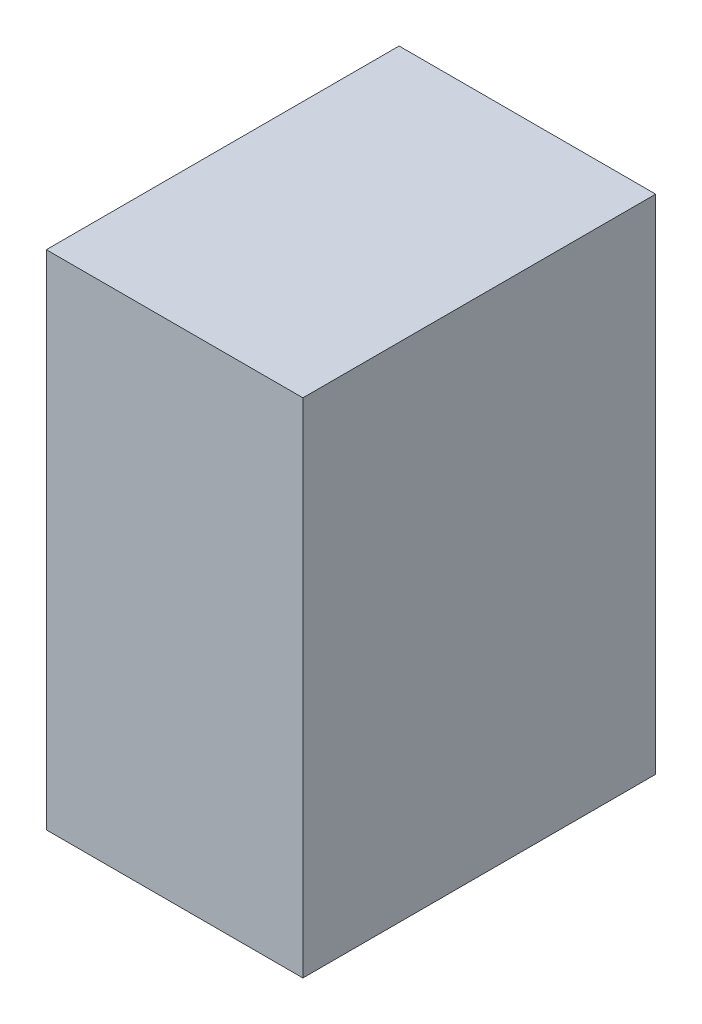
ISO-10303-21;
HEADER;
FILE_DESCRIPTION(('STEP AP214'),'2;1');
FILE_NAME('part.step','',(''),(''),'','','');
FILE_SCHEMA(('AUTOMOTIVE_DESIGN { 1 0 10303 214 1 1 1 1 }'));
ENDSEC;
DATA;
#1=APPLICATION_CONTEXT('core data for automotive mechanical design processes');
#2=APPLICATION_PROTOCOL_DEFINITION('international standard','automotive_design',2000,#1);
#3=PRODUCT_CONTEXT('',#1,'mechanical');
#4=PRODUCT('Part','Part','',(#3));
#5=PRODUCT_RELATED_PRODUCT_CATEGORY('part','',(#4));
#6=PRODUCT_DEFINITION_FORMATION('','',#4);
#7=PRODUCT_DEFINITION_CONTEXT('part definition',#1,'design');
#8=PRODUCT_DEFINITION('design','',#6,#7);
#9=PRODUCT_DEFINITION_SHAPE('','',#8);
#10=(LENGTH_UNIT() NAMED_UNIT(*) SI_UNIT(.MILLI.,.METRE.));
#11=(NAMED_UNIT(*) PLANE_ANGLE_UNIT() SI_UNIT($,.RADIAN.));
#12=(NAMED_UNIT(*) SI_UNIT($,.STERADIAN.) SOLID_ANGLE_UNIT());
#13=UNCERTAINTY_MEASURE_WITH_UNIT(LENGTH_MEASURE(1.E-05),#10,'distance_accuracy_value','');
#14=(GEOMETRIC_REPRESENTATION_CONTEXT(3) GLOBAL_UNCERTAINTY_ASSIGNED_CONTEXT((#13)) GLOBAL_UNIT_ASSIGNED_CONTEXT((#10,
#11,#12)) REPRESENTATION_CONTEXT('',''));
#15=CARTESIAN_POINT('',(0.,0.,0.));
#16=DIRECTION('',(0.,0.,1.));
#17=DIRECTION('',(1.,0.,0.));
#18=AXIS2_PLACEMENT_3D('',#15,#16,#17);
#19=CARTESIAN_POINT('',(120.,230.,330.));
#20=DIRECTION('',(-1.,0.,0.));
#21=DIRECTION('',(0.,-1.,0.));
#22=AXIS2_PLACEMENT_3D('',#19,#20,#21);
#23=PLANE('',#22);
#24=DIRECTION('',(0.,1.,0.));
#25=VECTOR('',#24,1.);
#26=CARTESIAN_POINT('',(120.,230.,0.));
#27=LINE('',#26,#25);
#28=CARTESIAN_POINT('',(120.,-240.,0.));
#29=VERTEX_POINT('',#28);
#30=CARTESIAN_POINT('',(120.,230.,0.));
#31=VERTEX_POINT('',#30);
#32=EDGE_CURVE('E94',#29,#31,#27,.T.);
#33=ORIENTED_EDGE('',*,*,#32,.T.);
#34=DIRECTION('',(0.,0.,-1.));
#35=VECTOR('',#34,1.);
#36=CARTESIAN_POINT('',(120.,230.,330.));
#37=LINE('',#36,#35);
#38=CARTESIAN_POINT('',(120.,230.,330.));
#39=VERTEX_POINT('',#38);
#40=EDGE_CURVE('E11',#39,#31,#37,.T.);
#41=ORIENTED_EDGE('',*,*,#40,.F.);
#42=DIRECTION('',(0.,1.,0.));
#43=VECTOR('',#42,1.);
#44=CARTESIAN_POINT('',(120.,230.,330.));
#45=LINE('',#44,#43);
#46=CARTESIAN_POINT('',(120.,-240.,330.));
#47=VERTEX_POINT('',#46);
#48=EDGE_CURVE('E82',#47,#39,#45,.T.);
#49=ORIENTED_EDGE('',*,*,#48,.F.);
#50=DIRECTION('',(0.,0.,-1.));
#51=VECTOR('',#50,1.);
#52=CARTESIAN_POINT('',(120.,-240.,330.));
#53=LINE('',#52,#51);
#54=EDGE_CURVE('E90',#47,#29,#53,.T.);
#55=ORIENTED_EDGE('',*,*,#54,.T.);
#56=EDGE_LOOP('',(#33,#41,#49,#55));
#57=FACE_BOUND('',#56,.T.);
#58=ADVANCED_FACE('F31',(#57),#23,.F.);
#59=CARTESIAN_POINT('',(-120.,230.,330.));
#60=DIRECTION('',(0.,-1.,0.));
#61=DIRECTION('',(0.,0.,-1.));
#62=AXIS2_PLACEMENT_3D('',#59,#60,#61);
#63=PLANE('',#62);
#64=DIRECTION('',(-1.,0.,0.));
#65=VECTOR('',#64,1.);
#66=CARTESIAN_POINT('',(-120.,230.,0.));
#67=LINE('',#66,#65);
#68=CARTESIAN_POINT('',(-120.,230.,0.));
#69=VERTEX_POINT('',#68);
#70=EDGE_CURVE('E86',#31,#69,#67,.T.);
#71=ORIENTED_EDGE('',*,*,#70,.T.);
#72=DIRECTION('',(0.,0.,-1.));
#73=VECTOR('',#72,1.);
#74=CARTESIAN_POINT('',(-120.,230.,330.));
#75=LINE('',#74,#73);
#76=CARTESIAN_POINT('',(-120.,230.,330.));
#77=VERTEX_POINT('',#76);
#78=EDGE_CURVE('E39',#77,#69,#75,.T.);
#79=ORIENTED_EDGE('',*,*,#78,.F.);
#80=DIRECTION('',(-1.,0.,0.));
#81=VECTOR('',#80,1.);
#82=CARTESIAN_POINT('',(-120.,230.,330.));
#83=LINE('',#82,#81);
#84=EDGE_CURVE('E77',#39,#77,#83,.T.);
#85=ORIENTED_EDGE('',*,*,#84,.F.);
#86=ORIENTED_EDGE('',*,*,#40,.T.);
#87=EDGE_LOOP('',(#71,#79,#85,#86));
#88=FACE_BOUND('',#87,.T.);
#89=ADVANCED_FACE('F85',(#88),#63,.F.);
#90=CARTESIAN_POINT('',(-120.,230.,330.));
#91=DIRECTION('',(1.,0.,0.));
#92=DIRECTION('',(0.,1.,0.));
#93=AXIS2_PLACEMENT_3D('',#90,#91,#92);
#94=PLANE('',#93);
#95=DIRECTION('',(0.,-1.,0.));
#96=VECTOR('',#95,1.);
#97=CARTESIAN_POINT('',(-120.,230.,0.));
#98=LINE('',#97,#96);
#99=CARTESIAN_POINT('',(-120.,-240.,0.));
#100=VERTEX_POINT('',#99);
#101=EDGE_CURVE('E64',#69,#100,#98,.T.);
#102=ORIENTED_EDGE('',*,*,#101,.T.);
#103=DIRECTION('',(0.,0.,-1.));
#104=VECTOR('',#103,1.);
#105=CARTESIAN_POINT('',(-120.,-240.,330.));
#106=LINE('',#105,#104);
#107=CARTESIAN_POINT('',(-120.,-240.,330.));
#108=VERTEX_POINT('',#107);
#109=EDGE_CURVE('E87',#108,#100,#106,.T.);
#110=ORIENTED_EDGE('',*,*,#109,.F.);
#111=DIRECTION('',(0.,-1.,0.));
#112=VECTOR('',#111,1.);
#113=CARTESIAN_POINT('',(-120.,230.,330.));
#114=LINE('',#113,#112);
#115=EDGE_CURVE('E80',#77,#108,#114,.T.);
#116=ORIENTED_EDGE('',*,*,#115,.F.);
#117=ORIENTED_EDGE('',*,*,#78,.T.);
#118=EDGE_LOOP('',(#102,#110,#116,#117));
#119=FACE_BOUND('',#118,.T.);
#120=ADVANCED_FACE('F88',(#119),#94,.F.);
#121=CARTESIAN_POINT('',(-120.,-240.,330.));
#122=DIRECTION('',(0.,1.,0.));
#123=DIRECTION('',(0.,0.,1.));
#124=AXIS2_PLACEMENT_3D('',#121,#122,#123);
#125=PLANE('',#124);
#126=DIRECTION('',(1.,0.,0.));
#127=VECTOR('',#126,1.);
#128=CARTESIAN_POINT('',(-120.,-240.,0.));
#129=LINE('',#128,#127);
#130=EDGE_CURVE('E70',#100,#29,#129,.T.);
#131=ORIENTED_EDGE('',*,*,#130,.T.);
#132=ORIENTED_EDGE('',*,*,#54,.F.);
#133=DIRECTION('',(1.,0.,0.));
#134=VECTOR('',#133,1.);
#135=CARTESIAN_POINT('',(-120.,-240.,330.));
#136=LINE('',#135,#134);
#137=EDGE_CURVE('E47',#108,#47,#136,.T.);
#138=ORIENTED_EDGE('',*,*,#137,.F.);
#139=ORIENTED_EDGE('',*,*,#109,.T.);
#140=EDGE_LOOP('',(#131,#132,#138,#139));
#141=FACE_BOUND('',#140,.T.);
#142=ADVANCED_FACE('F101',(#141),#125,.F.);
#143=CARTESIAN_POINT('',(120.,-240.,330.));
#144=DIRECTION('',(0.,0.,1.));
#145=DIRECTION('',(1.,0.,0.));
#146=AXIS2_PLACEMENT_3D('',#143,#144,#145);
#147=PLANE('',#146);
#148=ORIENTED_EDGE('',*,*,#48,.T.);
#149=ORIENTED_EDGE('',*,*,#84,.T.);
#150=ORIENTED_EDGE('',*,*,#115,.T.);
#151=ORIENTED_EDGE('',*,*,#137,.T.);
#152=EDGE_LOOP('',(#148,#149,#150,#151));
#153=FACE_BOUND('',#152,.T.);
#154=ADVANCED_FACE('F78',(#153),#147,.T.);
#155=CARTESIAN_POINT('',(120.,-240.,0.));
#156=DIRECTION('',(0.,0.,1.));
#157=DIRECTION('',(1.,0.,0.));
#158=AXIS2_PLACEMENT_3D('',#155,#156,#157);
#159=PLANE('',#158);
#160=ORIENTED_EDGE('',*,*,#32,.F.);
#161=ORIENTED_EDGE('',*,*,#130,.F.);
#162=ORIENTED_EDGE('',*,*,#101,.F.);
#163=ORIENTED_EDGE('',*,*,#70,.F.);
#164=EDGE_LOOP('',(#160,#161,#162,#163));
#165=FACE_BOUND('',#164,.T.);
#166=ADVANCED_FACE('F104',(#165),#159,.F.);
#167=CLOSED_SHELL('',(#58,#89,#120,#142,#154,#166));
#168=MANIFOLD_SOLID_BREP('B2',#167);
#169=ADVANCED_BREP_SHAPE_REPRESENTATION('',(#18,#168),#14);
#170=SHAPE_DEFINITION_REPRESENTATION(#9,#169);
ENDSEC;
END-ISO-10303-21;
